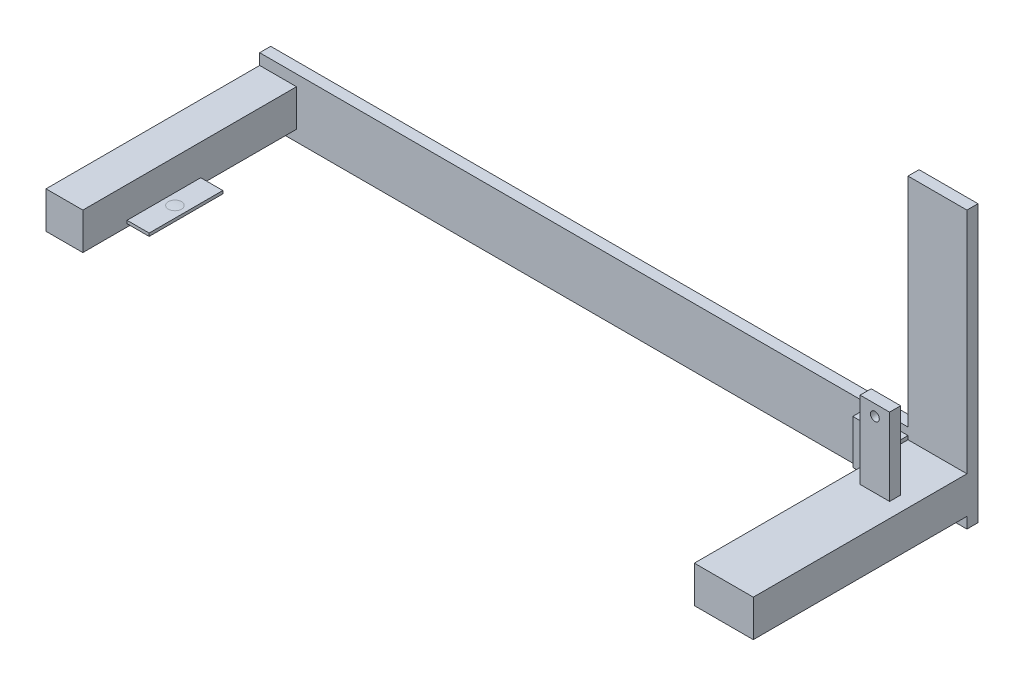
from build123d import *

# Parameters (mm, degrees)
BASE_EXTRUSION_DEPTH    = 15
ESQUISSE2_W             = 50
ESQUISSE2_H             = 50
BOSS_EXTRU_1_DEPTH      = 290
ESQUISSE3_W             = 80
ESQUISSE3_H             = 50
BOSS_EXTRU_2_DEPTH      = 290
ESQUISSE4_W             = 60
ESQUISSE4_H             = 60
ESQUISSE4_R             = 10
BOSS_EXTRU_3_DEPTH      = 15
ESQUISSE5_W             = 40
ESQUISSE5_H             = 15
BOSS_EXTRU_4_DEPTH      = 105
ENL_V_MAT_EXTRU_1_REACH = 891.466
ESQUISSE6_R             = 6
ESQUISSE7_W             = 100
ESQUISSE7_H             = 4
BOSS_EXTRU_5_DEPTH      = 30
ESQUISSE9_R             = 12.5
BOSS_EXTRU_7_DEPTH      = 5
ESQUISSE12_R            = 6
ENL_V_MAT_EXTRU_2_DEPTH = 30


with BuildPart() as part:
    # Esquisse1 → Base-Extrusion (new body)
    with BuildSketch(Plane.XY):
        Polygon((70, 10), (70, 305), (150, 305), (150, -70), (-810, -70), (-810, 10), align=None)
    extrude(amount=BASE_EXTRUSION_DEPTH)

    # Esquisse2 → Boss.-Extru.1 (add)
    with BuildSketch(Plane.XY.offset(15)):
        with Locations((-785, -30)):
            Rectangle(ESQUISSE2_W, ESQUISSE2_H)
    extrude(amount=BOSS_EXTRU_1_DEPTH)

    # Esquisse3 → Boss.-Extru.2 (add)
    with BuildSketch(Plane.XY.offset(15)):
        with Locations((110, -30)):
            Rectangle(ESQUISSE3_W, ESQUISSE3_H)
    extrude(amount=BOSS_EXTRU_2_DEPTH)

    # Esquisse4 → Boss.-Extru.3 (add)
    with BuildSketch(Plane.XY.offset(15)):
        with Locations((40, -30)):
            Rectangle(ESQUISSE4_W, ESQUISSE4_H)
        with Locations((40, -30)):
            Circle(ESQUISSE4_R, mode=Mode.SUBTRACT)
    extrude(amount=BOSS_EXTRU_3_DEPTH)

    # Esquisse5 → Boss.-Extru.4 (add)
    with BuildSketch(Plane(origin=(0, -5, 0), x_dir=(-1, 0, 0), z_dir=(0, 1, 0))):
        with Locations((-110, 92.5)):
            Rectangle(ESQUISSE5_W, ESQUISSE5_H)
    extrude(amount=BOSS_EXTRU_4_DEPTH)

    # Esquisse6 → Enl_v. mat.-Extru.1 (cut, up to next)
    with BuildSketch(Plane.XY.offset(100), mode=Mode.PRIVATE) as enl_v_mat_extru_1_sk1:
        with Locations((110, 85)):
            Circle(ESQUISSE6_R)
    enl_v_mat_extru_1_tool1 = extrude(enl_v_mat_extru_1_sk1.sketch, amount=-ENL_V_MAT_EXTRU_1_REACH, mode=Mode.PRIVATE) & part.part
    add(enl_v_mat_extru_1_tool1.solids().sort_by_distance((110, 85, 100))[0], mode=Mode.SUBTRACT)

    # Esquisse7 → Boss.-Extru.5 (add)
    with BuildSketch(Plane(origin=(-760, 0, 0), x_dir=(0, 0, -1), z_dir=(1, 0, 0))):
        with Locations((-195, -49)):
            Rectangle(ESQUISSE7_W, ESQUISSE7_H)
    extrude(amount=BOSS_EXTRU_5_DEPTH)

    # Esquisse9 → Boss.-Extru.7 (add)
    with BuildSketch(Plane.ZY.offset(-70)):
        with Locations(Location((277.5, -30, 0), (0, 0, 180))):
            Circle(ESQUISSE9_R)
    extrude(amount=BOSS_EXTRU_7_DEPTH)

    # Esquisse12 → Enl_v. mat.-Extru.2 (cut)
    with BuildSketch(Plane.ZY.offset(-65)):
        with Locations((277.5, -30)):
            Circle(ESQUISSE12_R)
    extrude(amount=-ENL_V_MAT_EXTRU_2_DEPTH, mode=Mode.SUBTRACT)

    # Esquisse13 → R_volution1 (revolve)
    with BuildSketch(Plane(origin=(-745, 0, 0), x_dir=(0, 0, -1), z_dir=(1, 0, 0))):
        with BuildLine():
            Line((-195, -46.6), (-195, -47))
            Line((-195, -47), (-186.064676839, -47))
            ThreePointArc((-186.064676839, -47), (-190.527864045, -46.70005005), (-195, -46.6))
        make_face()
    revolve(axis=Axis((-745, -46.6, 195), (0, -1, 0)))


solid = part.part
